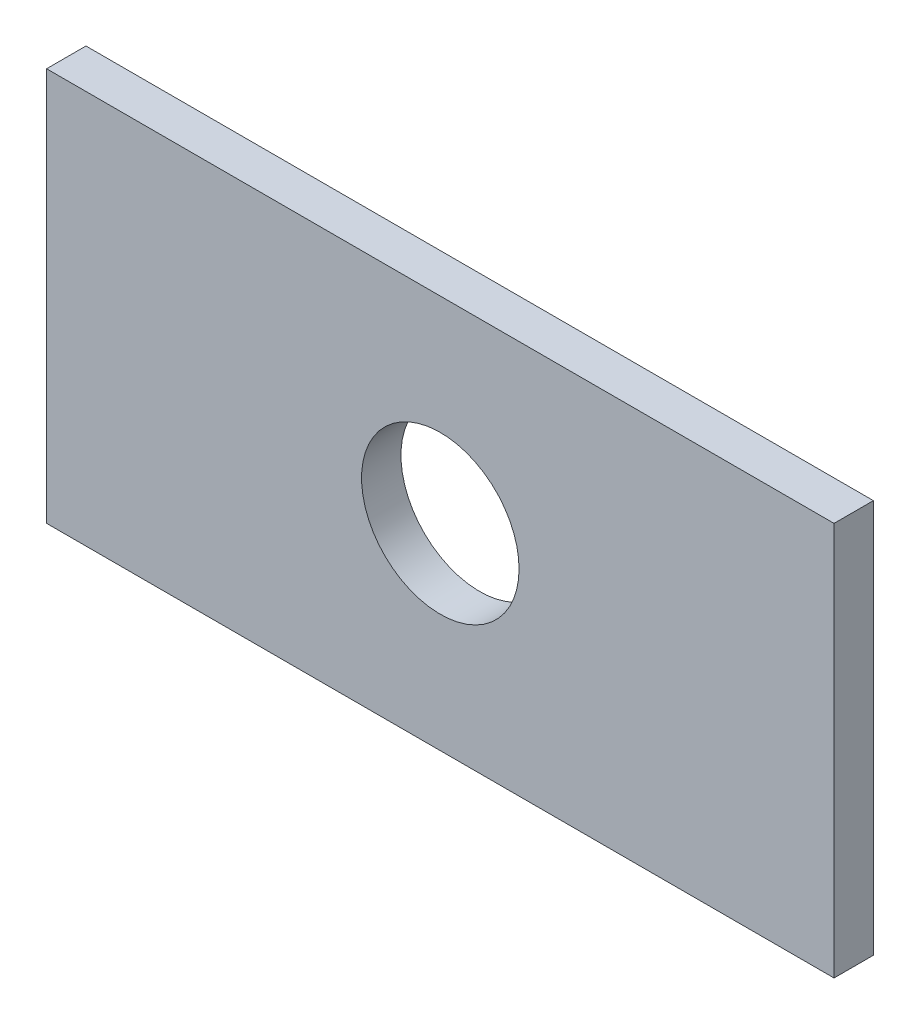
from build123d import *

# Parameters (mm, degrees)
SKETCH1_W          = 100
SKETCH1_H          = 50
BASE_EXTRUDE_DEPTH = 5
SKETCH3_R          = 10
CUT_EXTRUDE2_DEPTH = 112.915146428


with BuildPart() as part:
    # Sketch1 → Base-Extrude (new body)
    with BuildSketch(Plane.XY):
        with Locations((50, 25)):
            Rectangle(SKETCH1_W, SKETCH1_H)
    extrude(amount=BASE_EXTRUDE_DEPTH)

    # Sketch3 → Cut-Extrude2 (cut, through all)
    with BuildSketch(Plane.XY.offset(5)):
        with Locations((50, 25)):
            Circle(SKETCH3_R)
    extrude(amount=-CUT_EXTRUDE2_DEPTH, mode=Mode.SUBTRACT)


solid = part.part
